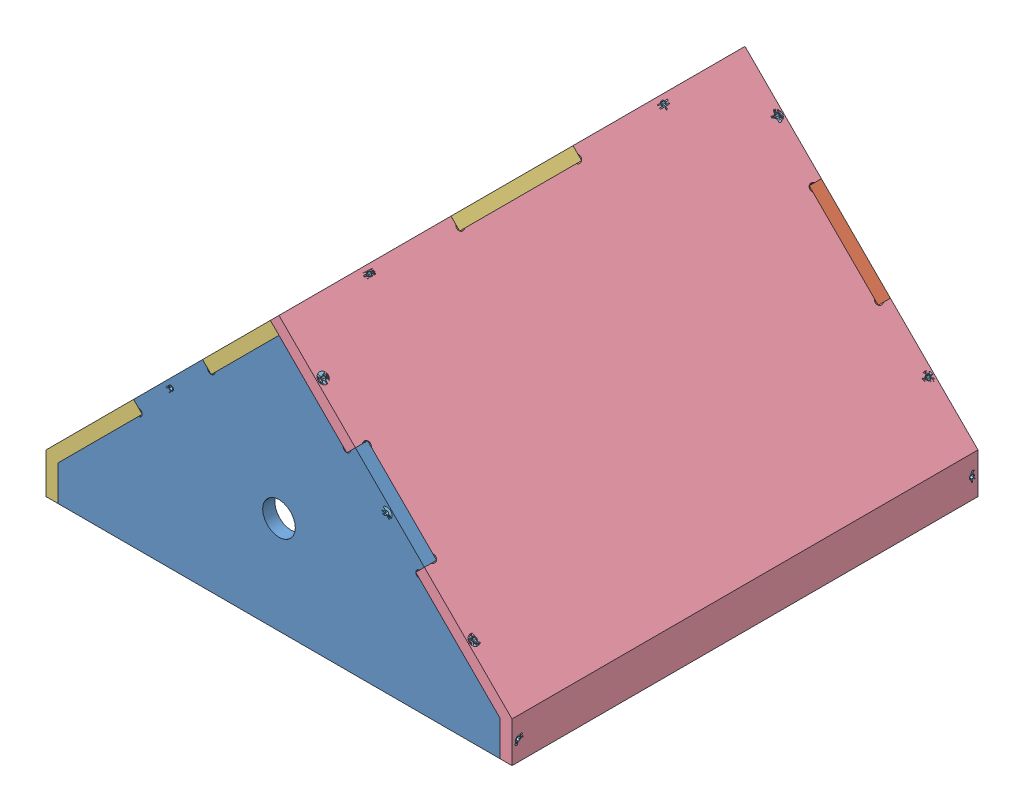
SolidWorks assembly Toiture.SLDASM, configuration Défaut (file format 5000). Lengths in mm.
Overall size (191 112.41 191.94).
23 component instances, 5 part files, 46 mates.
Components (placement in the parent):
- Pignon_2-2: Pignon_2.SLDPRT [Défaut] at (-31.068 65.4426 5.5) size (181 105 5)
- Pignon-1: Pignon.SLDPRT [Défaut] at (-31.068 65.4426 -180.5) size (181 105 5)
- Toit G-1: Toit G.SLDPRT [Défaut] at (-121.568 65.4426 -180.5) size (99.04 112.07 191)
- Toit D-1: Toit D.SLDPRT [Défaut] at (59.432 65.4426 10.5) x (-1 0 0) z (0 0 -1) size (99.04 112.07 191)
- VIS TORCX TF 2.2X13-1: VIS TORCX TF 2.2X13.SLDPRT [Défaut] at (-75.3214 129.565 10.5) size (4.2 4.2 13)
- VIS TORCX TF 2.2X13-2: VIS TORCX TF 2.2X13.SLDPRT [Défaut] at (13.1854 129.565 10.5) size (4.2 4.2 13)
- VIS TORCX TF 2.2X13-4: VIS TORCX TF 2.2X13.SLDPRT [Défaut] at (13.1854 129.565 -180.5) x (-0.923728 -0.383049 0) z (0 0 -1) size (4.2 4.2 13)
- VIS TORCX TF 2.2X13-5: VIS TORCX TF 2.2X13.SLDPRT [Défaut] at (-75.3214 129.565 -180.5) x (-0.923728 -0.383049 0) z (0 0 -1) size (4.2 4.2 13)
- VIS TORCX TF 2.2X13-6: VIS TORCX TF 2.2X13.SLDPRT [Défaut] at (-126.568 73.7282 -178) x (0 0 1) z (-1 0 0) size (4.2 4.2 13)
- VIS TORCX TF 2.2X13-7: VIS TORCX TF 2.2X13.SLDPRT [Défaut] at (-108.62 99.9617 -178) x (0.5 0.5 0.707107) z (-0.707107 0.707107 0) size (4.2 4.2 13)
- VIS TORCX TF 2.2X13-8: VIS TORCX TF 2.2X13.SLDPRT [Défaut] at (-48.4944 160.0873 -178) x (0.5 0.5 0.707107) z (-0.707107 0.707107 0) size (4.2 4.2 13)
- VIS TORCX TF 2.2X13-9: VIS TORCX TF 2.2X13.SLDPRT [Défaut] at (-32.8332 175.7485 -85) x (0.5 0.5 0.707107) z (-0.707107 0.707107 0) size (4.2 4.2 13)
- VIS TORCX TF 2.2X13-16: VIS TORCX TF 2.2X13.SLDPRT [Défaut] at (-48.4944 160.0873 8) x (0.5 0.5 0.707107) z (-0.707107 0.707107 0) size (4.2 4.2 13)
- VIS TORCX TF 2.2X13-17: VIS TORCX TF 2.2X13.SLDPRT [Défaut] at (-108.62 99.9617 8) x (0.5 0.5 0.707107) z (-0.707107 0.707107 0) size (4.2 4.2 13)
- VIS TORCX TF 2.2X13-18: VIS TORCX TF 2.2X13.SLDPRT [Défaut] at (-126.568 73.7282 8) x (0 0 1) z (-1 0 0) size (4.2 4.2 13)
- VIS TORCX TF 2.2X13-23: VIS TORCX TF 2.2X13.SLDPRT [Défaut] at (64.432 73.7282 8) x (0 0 -1) z (1 0 0) size (4.2 4.2 13)
- VIS TORCX TF 2.2X13-24: VIS TORCX TF 2.2X13.SLDPRT [Défaut] at (46.4841 99.9617 8) x (0.5 -0.5 -0.707107) z (0.707107 0.707107 0) size (4.2 4.2 13)
- VIS TORCX TF 2.2X13-25: VIS TORCX TF 2.2X13.SLDPRT [Défaut] at (-15.4094 161.8551 8) x (0.5 -0.5 -0.707107) z (0.707107 0.707107 0) size (4.2 4.2 13)
- VIS TORCX TF 2.2X13-27: VIS TORCX TF 2.2X13.SLDPRT [Défaut] at (-29.3015 175.7472 -145.25) x (0.5 -0.5 -0.707107) z (0.707107 0.707107 0) size (4.2 4.2 13)
- VIS TORCX TF 2.2X13-28: VIS TORCX TF 2.2X13.SLDPRT [Défaut] at (-15.4094 161.8551 -178) x (0.5 -0.5 -0.707107) z (0.707107 0.707107 0) size (4.2 4.2 13)
- VIS TORCX TF 2.2X13-29: VIS TORCX TF 2.2X13.SLDPRT [Défaut] at (46.4841 99.9617 -178) x (0.5 -0.5 -0.707107) z (0.707107 0.707107 0) size (4.2 4.2 13)
- VIS TORCX TF 2.2X13-30: VIS TORCX TF 2.2X13.SLDPRT [Défaut] at (64.432 73.7282 -178) x (0 0 -1) z (1 0 0) size (4.2 4.2 13)
- VIS TORCX TF 2.2X13-38: VIS TORCX TF 2.2X13.SLDPRT [Défaut] at (-29.2059 175.6516 -24.6197) x (0.5 -0.5 -0.707107) z (0.707107 0.707107 0) size (4.2 4.2 13)
Mates (geometry in assembly coordinates):
- Coïncidente19: coincident aligned: plane of Pignon_2-2 through (-121.568 65.4426 10.5) normal (-1 0 0); plane of Pignon-1 through (-121.568 65.4426 -175.5) normal (-1 0 0)
- Coïncidente20: coincident aligned: plane of Pignon_2-2 through (59.432 65.4426 10.5) normal (0 -1 0); plane of Pignon-1 through (59.432 65.4426 -175.5) normal (0 -1 0)
- Coïncidente22: coincident aligned: plane of Pignon_2-2 through (-88.6365 114.3741 10.5) normal (0 0 1); plane of Toit G-1 through (-121.568 65.4426 10.5) normal (0 0 1)
- Coïncidente23: coincident anti-aligned: plane of Pignon_2-2 through (-121.568 65.4426 10.5) normal (-1 0 0); plane of Toit G-1 through (-121.568 79.9426 10.5) normal (1 0 0)
- Coïncidente24: coincident aligned: plane of Pignon_2-2 through (59.432 65.4426 10.5) normal (0 -1 0); plane of Toit G-1 through (-121.568 65.4426 10.5) normal (0 -1 0)
- Coïncidente25: coincident anti-aligned: plane of Pignon_2-2 through (59.432 65.4426 10.5) normal (1 0 0); plane of Toit D-1 through (59.432 79.9426 -180.5) normal (-1 0 0)
- Coïncidente26: coincident aligned: plane of Pignon_2-2 through (-88.6365 114.3741 10.5) normal (0 0 1); plane of Toit D-1 through (59.432 65.4426 10.5) normal (0 0 1)
- Coïncidente27: coincident aligned: plane of Pignon_2-2 through (59.432 65.4426 10.5) normal (0 -1 0); plane of Toit D-1 through (59.432 65.4426 -180.5) normal (0 -1 0)
- Coïncidente28: coincident anti-aligned: axis of Pignon_2-2 through (-75.3214 129.565 10.5) axis (0 0 -1); axis of VIS TORCX TF 2.2X13-1 through (-75.3214 129.565 -0.5947) axis (0 0 1)
- Coïncidente29: coincident aligned: plane of Pignon_2-2 through (-88.6365 114.3741 10.5) normal (0 0 1); plane of VIS TORCX TF 2.2X13-1 through (-75.3214 131.665 10.5) normal (0 0 1)
- Coïncidente30: coincident anti-aligned: axis of Pignon_2-2 through (13.1854 129.565 10.5) axis (0 0 -1); axis of VIS TORCX TF 2.2X13-2 through (13.1854 129.565 -0.5947) axis (0 0 1)
- Coïncidente31: coincident aligned: plane of Pignon_2-2 through (-88.6365 114.3741 10.5) normal (0 0 1); plane of VIS TORCX TF 2.2X13-2 through (13.1854 131.665 10.5) normal (0 0 1)
- Coïncidente32: coincident aligned: axis of Pignon-1 through (-75.3214 129.565 -175.5) axis (0 0 -1); axis of VIS TORCX TF 2.2X13-5 through (-75.3214 129.565 -169.4053) axis (0 0 -1)
- Coïncidente33: coincident aligned: plane of Pignon-1 through (-88.6365 114.3741 -180.5) normal (0 0 -1); plane of VIS TORCX TF 2.2X13-5 through (-76.1258 131.5048 -180.5) normal (0 0 -1)
- Coïncidente34: coincident aligned: axis of Pignon-1 through (13.1854 129.565 -175.5) axis (0 0 -1); axis of VIS TORCX TF 2.2X13-4 through (13.1854 129.565 -169.4053) axis (0 0 -1)
- Coïncidente35: coincident aligned: plane of Pignon-1 through (-88.6365 114.3741 -180.5) normal (0 0 -1); plane of VIS TORCX TF 2.2X13-4 through (12.381 131.5048 -180.5) normal (0 0 -1)
- Coïncidente36: coincident aligned: axis of Toit G-1 through (-121.568 73.7282 8) axis (-1 0 0); axis of VIS TORCX TF 2.2X13-18 through (-115.4732 73.7282 8) axis (-1 0 0)
- Coïncidente37: coincident aligned: plane of Toit G-1 through (-126.568 65.4426 10.5) normal (-1 0 0); plane of VIS TORCX TF 2.2X13-18 through (-126.568 75.8282 8) normal (-1 0 0)
- Coïncidente38: coincident aligned: axis of Toit G-1 through (-105.0845 96.4261 8) axis (-0.707107 0.707107 0); axis of VIS TORCX TF 2.2X13-17 through (-100.7749 92.1165 8) axis (-0.707107 0.707107 0)
- Coïncidente39: coincident aligned: plane of Toit G-1 through (-126.568 82.0137 10.5) normal (-0.707107 0.707107 0); plane of VIS TORCX TF 2.2X13-17 through (-107.57 101.0117 6.5151) normal (-0.707107 0.707107 0)
- Coïncidente40: coincident aligned: axis of Toit G-1 through (-44.9588 156.5518 8) axis (-0.707107 0.707107 0); axis of VIS TORCX TF 2.2X13-16 through (-40.6492 152.2422 8) axis (-0.707107 0.707107 0)
- Coïncidente41: coincident aligned: plane of Toit G-1 through (-126.568 82.0137 10.5) normal (-0.707107 0.707107 0); plane of VIS TORCX TF 2.2X13-16 through (-47.4444 161.1373 6.5151) normal (-0.707107 0.707107 0)
- Coïncidente42: coincident aligned: axis of Toit G-1 through (-121.568 73.7282 -178) axis (-1 0 0); axis of VIS TORCX TF 2.2X13-6 through (-115.4732 73.7282 -178) axis (-1 0 0)
- Coïncidente43: coincident aligned: plane of Toit G-1 through (-126.568 65.4426 10.5) normal (-1 0 0); plane of VIS TORCX TF 2.2X13-6 through (-126.568 75.8282 -178) normal (-1 0 0)
- Coïncidente44: coincident aligned: axis of Toit G-1 through (-105.0845 96.4261 -178) axis (-0.707107 0.707107 0); axis of VIS TORCX TF 2.2X13-7 through (-100.7749 92.1165 -178) axis (-0.707107 0.707107 0)
- Coïncidente45: coincident aligned: plane of Toit G-1 through (-126.568 82.0137 10.5) normal (-0.707107 0.707107 0); plane of VIS TORCX TF 2.2X13-7 through (-107.57 101.0117 -179.4849) normal (-0.707107 0.707107 0)
- Coïncidente46: coincident aligned: axis of Toit G-1 through (-44.9588 156.5518 -178) axis (-0.707107 0.707107 0); axis of VIS TORCX TF 2.2X13-8 through (-40.6492 152.2422 -178) axis (-0.707107 0.707107 0)
- Coïncidente47: coincident aligned: plane of Toit G-1 through (-126.568 82.0137 10.5) normal (-0.707107 0.707107 0); plane of VIS TORCX TF 2.2X13-8 through (-47.4444 161.1373 -179.4849) normal (-0.707107 0.707107 0)
- Coïncidente48: coincident aligned: axis of Toit G-1 through (-29.2976 172.213 -85) axis (-0.707107 0.707107 0); axis of VIS TORCX TF 2.2X13-9 through (-24.988 167.9034 -85) axis (-0.707107 0.707107 0)
- Coïncidente49: coincident aligned: plane of Toit G-1 through (-126.568 82.0137 10.5) normal (-0.707107 0.707107 0); plane of VIS TORCX TF 2.2X13-9 through (-31.7832 176.7985 -86.4849) normal (-0.707107 0.707107 0)
- Coïncidente50: coincident aligned: axis of Toit D-1 through (59.432 73.7282 -178) axis (1 0 0); axis of VIS TORCX TF 2.2X13-30 through (53.3373 73.7282 -178) axis (1 0 0)
- Coïncidente51: coincident aligned: plane of Toit D-1 through (64.432 65.4426 -180.5) normal (1 0 0); plane of VIS TORCX TF 2.2X13-30 through (64.432 75.8282 -178) normal (1 0 0)
- Coïncidente52: coincident aligned: axis of Toit D-1 through (42.9485 96.4261 -178) axis (0.707107 0.707107 0); axis of VIS TORCX TF 2.2X13-29 through (38.6389 92.1165 -178) axis (0.707107 0.707107 0)
- Coïncidente53: coincident aligned: plane of Toit D-1 through (64.432 82.0137 -180.5) normal (0.707107 0.707107 0); plane of VIS TORCX TF 2.2X13-29 through (45.4341 101.0117 -179.4849) normal (0.707107 0.707107 0)
- Coïncidente54: coincident aligned: axis of Toit D-1 through (-18.9449 158.3196 -178) axis (0.707107 0.707107 0); axis of VIS TORCX TF 2.2X13-28 through (-23.2545 154.0099 -178) axis (0.707107 0.707107 0)
- Coïncidente55: coincident aligned: plane of Toit D-1 through (64.432 82.0137 -180.5) normal (0.707107 0.707107 0); plane of VIS TORCX TF 2.2X13-28 through (-16.4594 162.9051 -179.4849) normal (0.707107 0.707107 0)
- Coïncidente56: coincident aligned: axis of Toit D-1 through (-32.837 172.2117 -145.25) axis (0.707107 0.707107 0); axis of VIS TORCX TF 2.2X13-27 through (-37.1467 167.9021 -145.25) axis (0.707107 0.707107 0)
- Coïncidente57: coincident aligned: plane of Toit D-1 through (64.432 82.0137 -180.5) normal (0.707107 0.707107 0); plane of VIS TORCX TF 2.2X13-27 through (-30.3515 176.7972 -146.7349) normal (0.707107 0.707107 0)
- Coïncidente58: coincident aligned: axis of Toit D-1 through (59.432 73.7282 8) axis (1 0 0); axis of VIS TORCX TF 2.2X13-23 through (53.3373 73.7282 8) axis (1 0 0)
- Coïncidente59: coincident aligned: plane of Toit D-1 through (64.432 65.4426 -180.5) normal (1 0 0); plane of VIS TORCX TF 2.2X13-23 through (64.432 75.8282 8) normal (1 0 0)
- Coïncidente60: coincident aligned: axis of Toit D-1 through (42.9485 96.4261 8) axis (0.707107 0.707107 0); axis of VIS TORCX TF 2.2X13-24 through (38.6389 92.1165 8) axis (0.707107 0.707107 0)
- Coïncidente61: coincident aligned: plane of Toit D-1 through (64.432 82.0137 -180.5) normal (0.707107 0.707107 0); plane of VIS TORCX TF 2.2X13-24 through (45.4341 101.0117 6.5151) normal (0.707107 0.707107 0)
- Coïncidente62: coincident aligned: axis of Toit D-1 through (-18.9449 158.3196 8) axis (0.707107 0.707107 0); axis of VIS TORCX TF 2.2X13-25 through (-23.2545 154.0099 8) axis (0.707107 0.707107 0)
- Coïncidente63: coincident aligned: plane of Toit D-1 through (64.432 82.0137 -180.5) normal (0.707107 0.707107 0); plane of VIS TORCX TF 2.2X13-25 through (-16.4594 162.9051 6.5151) normal (0.707107 0.707107 0)
- Coïncidente65: coincident: axis of Toit D-1 through (-32.7414 172.1161 -24.6197) axis (0.707107 0.707107 0); axis of VIS TORCX TF 2.2X13-38 through (-37.0511 167.8064 -24.6197) axis (0.707107 0.707107 0)
- Coïncidente66: coincident aligned: plane of Toit D-1 through (64.432 82.0137 -180.5) normal (0.707107 0.707107 0); plane of VIS TORCX TF 2.2X13-38 through (-30.2559 176.7016 -26.1046) normal (0.707107 0.707107 0)
